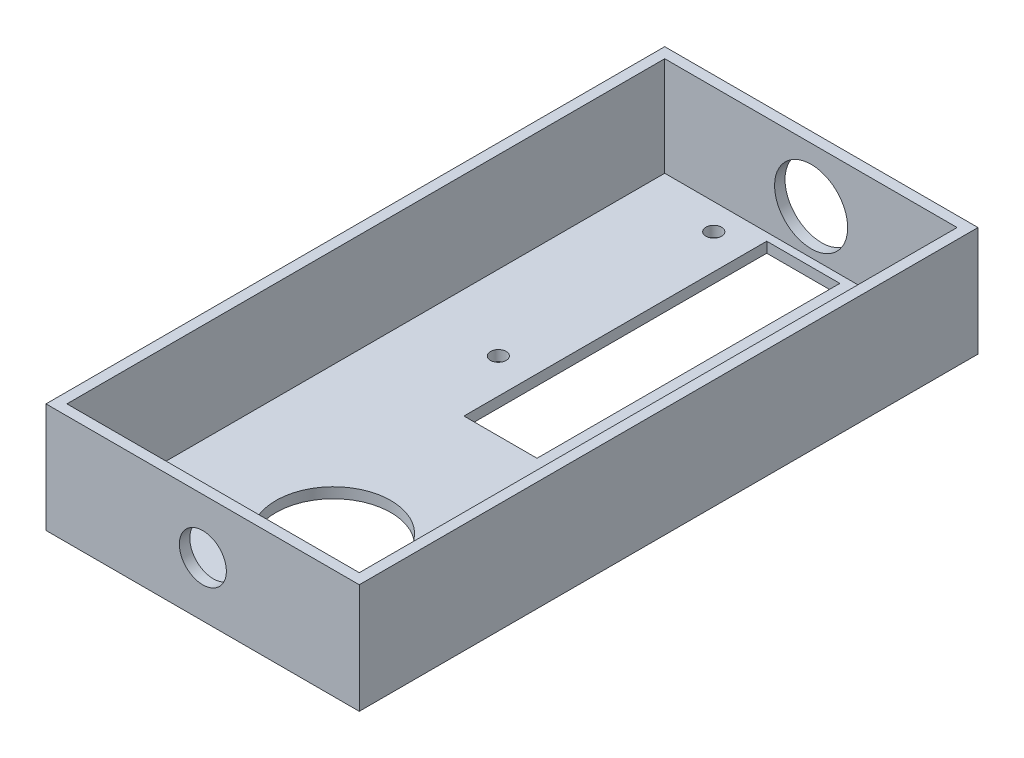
from build123d import *

# Parameters (mm, degrees)
SKETCH_1_W          = 60
SKETCH_1_H          = 100
EXTRUDE_1_DEPTH     = 2
SKETCH_2_W          = 14
SKETCH_2_H          = 58
CUT_EXTRUDE_1_DEPTH = 10
SKETCH_3_W          = 59.72242421
SKETCH_3_H          = 30
SKETCH_3_R          = 7
EXTRUDE_2_DEPTH     = 2
SKETCH_4_R          = 1.505004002
SKETCH_4_R_2        = 1.499996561
SKETCH_4_R_3        = 1.5
CUT_EXTRUDE_2_DEPTH = 3
SKETCH_6_W          = 60
SKETCH_6_H          = 42
EXTRUDE_3_DEPTH     = 2
SKETCH_7_R          = 11
CUT_EXTRUDE_3_DEPTH = 2
EXTRUDE_6_DEPTH     = 2
SKETCH_10_W         = 0.27757579
SKETCH_10_H         = 2
EXTRUDE_7_DEPTH     = 30
SKETCH_11_W         = 2
SKETCH_11_H         = 138
EXTRUDE_8_DEPTH     = 30
SKETCH_14_R         = 4.5
CUT_EXTRUDE_4_DEPTH = 3
SKETCH_15_R         = 4.5
CUT_EXTRUDE_5_DEPTH = 3
SKETCH_16_R         = 4.5
EXTRUDE_9_DEPTH     = 2
SKETCH_17_R         = 4.5
CUT_EXTRUDE_6_DEPTH = 2
EXTRUDE_10_DEPTH    = 30
CUT_EXTRUDE_START   = -30
SKETCH_19_R         = 4.5
CUT_EXTRUDE_7_DEPTH = 30
SKETCH_20_W         = 60
SKETCH_20_H         = 23.5
CUT_EXTRUDE_8_DEPTH = 34
SKETCH_21_W         = 60
SKETCH_21_H         = 13
CUT_EXTRUDE_9_DEPTH = 162
SKETCH_22_W         = 60
SKETCH_22_H         = 118.5
SKETCH_22_W_2       = 56
SKETCH_22_H_2       = 114.497446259
EXTRUDE_11_DEPTH    = 2


with BuildPart() as part:
    # Sketch 1 → Extrude 1 (new body)
    with BuildSketch(Plane(origin=(0, 0, 0), x_dir=(1, 0, 0), z_dir=(0, 1, 0))):
        with Locations((30, 50)):
            Rectangle(SKETCH_1_W, SKETCH_1_H)
    extrude(amount=EXTRUDE_1_DEPTH)

    # Sketch 2 → Cut-Extrude 1 (cut)
    with BuildSketch(Plane(origin=(0, 2, 0), x_dir=(1, 0, 0), z_dir=(0, 1, 0))):
        with Locations((30.039564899, 67.502553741)):
            Rectangle(SKETCH_2_W, SKETCH_2_H)
    extrude(amount=-CUT_EXTRUDE_1_DEPTH, mode=Mode.SUBTRACT)

    # Sketch 3 → Extrude 2 (add)
    with BuildSketch(Plane(origin=(0, 0, -100), x_dir=(-1, 0, 0), z_dir=(0, 0, -1))):
        with Locations((-30.138787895, 17)):
            Rectangle(SKETCH_3_W, SKETCH_3_H)
        with Locations((-30.039564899, 10.5)):
            Circle(SKETCH_3_R, mode=Mode.SUBTRACT)
    extrude(amount=-EXTRUDE_2_DEPTH)

    # Sketch 4 → Cut-Extrude 2 (cut)
    with BuildSketch(Plane(origin=(0, 2, 0), x_dir=(1, 0, 0), z_dir=(0, 1, 0))):
        with Locations(Location((16.388302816, 93.002553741, 0), (0, 0, 270))):
            Circle(SKETCH_4_R)
        with Locations(Location((43.755108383, 93.002553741, 0), (0, 0, 270))):
            Circle(SKETCH_4_R_2)
        with Locations(Location((16.367019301, 51.768534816, 0), (0, 0, 270))):
            Circle(SKETCH_4_R_3)
        with Locations(Location((43.738919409, 51.768534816, 0), (0, 0, 270))):
            Circle(SKETCH_4_R_3)
    extrude(amount=-CUT_EXTRUDE_2_DEPTH, mode=Mode.SUBTRACT)

    # Sketch 6 → Extrude 3 (add)
    with BuildSketch(Plane(origin=(0, 2, 0), x_dir=(1, 0, 0), z_dir=(0, 1, 0))):
        with Locations((30, -21)):
            Rectangle(SKETCH_6_W, SKETCH_6_H)
    extrude(amount=-EXTRUDE_3_DEPTH)

    # Sketch 7 → Cut-Extrude 3 (cut)
    with BuildSketch(Plane(origin=(0, 2, 0), x_dir=(1, 0, 0), z_dir=(0, 1, 0))):
        with Locations(Location((30.039564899, 6.502553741, 0), (0, 0, 270))):
            Circle(SKETCH_7_R)
    extrude(amount=-CUT_EXTRUDE_3_DEPTH, mode=Mode.SUBTRACT)

    # Sketch 9 → Extrude 6 (add)
    with BuildSketch(Plane.XY.offset(42)):
        with BuildLine():
            ThreePointArc((48.889281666, 17), (51.889281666, 20), (54.889281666, 17))
            Line((54.889281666, 17), (60, 17))
            Line((60, 17), (60, 32))
            Line((60, 32), (0, 32))
            Line((0, 32), (0, 17))
            Line((0, 17), (5.632927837, 17))
            ThreePointArc((5.632927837, 17), (8.632927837, 20), (11.632927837, 17))
            Line((11.632927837, 17), (48.889281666, 17))
        make_face()
        with BuildLine():
            Line((60, 17), (54.889281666, 17))
            ThreePointArc((54.889281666, 17), (51.889281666, 14), (48.889281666, 17))
            Line((48.889281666, 17), (11.632927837, 17))
            ThreePointArc((11.632927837, 17), (8.632927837, 14), (5.632927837, 17))
            Line((5.632927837, 17), (0, 17))
            Line((0, 17), (0, 2))
            Line((0, 2), (60, 2))
            Line((60, 2), (60, 17))
        make_face()
    extrude(amount=-EXTRUDE_6_DEPTH)

    # Sketch 10 → Extrude 7 (add)
    with BuildSketch(Plane(origin=(0, 32, 0), x_dir=(1, 0, 0), z_dir=(0, 1, 0))):
        with Locations((0.138787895, 99)):
            Rectangle(SKETCH_10_W, SKETCH_10_H)
    extrude(amount=-EXTRUDE_7_DEPTH)

    # Sketch 11 → Extrude 8 (add)
    with BuildSketch(Plane(origin=(0, 2, 0), x_dir=(1, 0, 0), z_dir=(0, 1, 0))):
        with Locations((1, 29)):
            Rectangle(SKETCH_11_W, SKETCH_11_H)
        with Locations((59, 29)):
            Rectangle(SKETCH_11_W, SKETCH_11_H)
    extrude(amount=EXTRUDE_8_DEPTH)

    # Sketch 14 → Cut-Extrude 4 (cut)
    with BuildSketch(Plane.XY.offset(42)):
        with Locations((8.632927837, 17)):
            Circle(SKETCH_14_R)
    extrude(amount=-CUT_EXTRUDE_4_DEPTH, mode=Mode.SUBTRACT)

    # Sketch 15 → Cut-Extrude 5 (cut)
    with BuildSketch(Plane.XY.offset(42)):
        with Locations((51.889281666, 17)):
            Circle(SKETCH_15_R)
    extrude(amount=-CUT_EXTRUDE_5_DEPTH, mode=Mode.SUBTRACT)

    # Sketch 16 → Extrude 9 (add)
    with BuildSketch(Plane.XY.offset(42)):
        with Locations((8.632927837, 17)):
            Circle(SKETCH_16_R)
        with Locations((51.889281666, 17)):
            Circle(SKETCH_16_R)
    extrude(amount=-EXTRUDE_9_DEPTH)

    # Sketch 17 → Cut-Extrude 6 (cut)
    with BuildSketch(Plane(origin=(0, 0, 40), x_dir=(-1, 0, 0), z_dir=(0, 0, -1))):
        with Locations((-30.039564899, 10.5)):
            Circle(SKETCH_17_R)
    extrude(amount=-CUT_EXTRUDE_6_DEPTH, mode=Mode.SUBTRACT)

    # Sketch 18 → Extrude 10 (add)
    with BuildSketch(Plane(origin=(0, 2, 0), x_dir=(1, 0, 0), z_dir=(0, 1, 0))):
        Polygon((2, -40), (58, -40), (58, -16.497446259), (30.039564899, -16.497446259), (2, -16.497446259), align=None)
    extrude(amount=EXTRUDE_10_DEPTH)

    # Sketch 19 → Cut-Extrude 7 (cut)
    with BuildSketch(Plane.XY.offset(42).offset(CUT_EXTRUDE_START)):
        with Locations(Location((30.039564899, 10.5, 0), (0, 0, 180))):
            Circle(SKETCH_19_R)
    extrude(amount=CUT_EXTRUDE_7_DEPTH, mode=Mode.SUBTRACT)

    # Sketch 20 → Cut-Extrude 8 (cut)
    with BuildSketch(Plane(origin=(0, 32, 0), x_dir=(1, 0, 0), z_dir=(0, 1, 0))):
        with Locations((30, -30.25)):
            Rectangle(SKETCH_20_W, SKETCH_20_H)
    extrude(amount=-CUT_EXTRUDE_8_DEPTH, mode=Mode.SUBTRACT)

    # Sketch 21 → Cut-Extrude 9 (cut)
    with BuildSketch(Plane.XY.offset(18.5)):
        with Locations((30, 25.5)):
            Rectangle(SKETCH_21_W, SKETCH_21_H)
    extrude(amount=-CUT_EXTRUDE_9_DEPTH, mode=Mode.SUBTRACT)

    # Sketch 22 → Extrude 11 (add)
    with BuildSketch(Plane(origin=(0, 19, 0), x_dir=(1, 0, 0), z_dir=(0, 1, 0))):
        with Locations((30, 40.75)):
            Rectangle(SKETCH_22_W, SKETCH_22_H)
        with Locations((30, 40.75127687)):
            Rectangle(SKETCH_22_W_2, SKETCH_22_H_2, mode=Mode.SUBTRACT)
    extrude(amount=EXTRUDE_11_DEPTH)


solid = part.part
